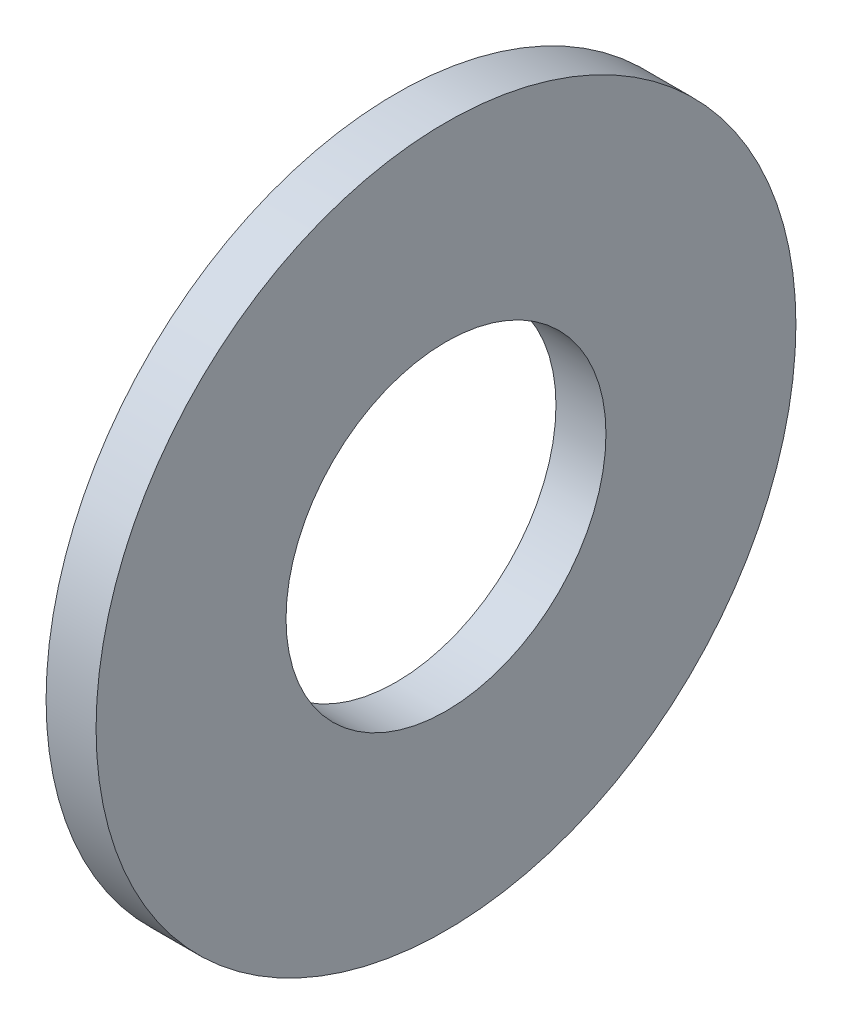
ISO-10303-21;
HEADER;
FILE_DESCRIPTION(('STEP AP214'),'2;1');
FILE_NAME('part.step','',(''),(''),'','','');
FILE_SCHEMA(('AUTOMOTIVE_DESIGN { 1 0 10303 214 1 1 1 1 }'));
ENDSEC;
DATA;
#1=APPLICATION_CONTEXT('core data for automotive mechanical design processes');
#2=APPLICATION_PROTOCOL_DEFINITION('international standard','automotive_design',2000,#1);
#3=PRODUCT_CONTEXT('',#1,'mechanical');
#4=PRODUCT('Part','Part','',(#3));
#5=PRODUCT_RELATED_PRODUCT_CATEGORY('part','',(#4));
#6=PRODUCT_DEFINITION_FORMATION('','',#4);
#7=PRODUCT_DEFINITION_CONTEXT('part definition',#1,'design');
#8=PRODUCT_DEFINITION('design','',#6,#7);
#9=PRODUCT_DEFINITION_SHAPE('','',#8);
#10=(LENGTH_UNIT() NAMED_UNIT(*) SI_UNIT(.MILLI.,.METRE.));
#11=(NAMED_UNIT(*) PLANE_ANGLE_UNIT() SI_UNIT($,.RADIAN.));
#12=(NAMED_UNIT(*) SI_UNIT($,.STERADIAN.) SOLID_ANGLE_UNIT());
#13=UNCERTAINTY_MEASURE_WITH_UNIT(LENGTH_MEASURE(1.E-05),#10,'distance_accuracy_value','');
#14=(GEOMETRIC_REPRESENTATION_CONTEXT(3) GLOBAL_UNCERTAINTY_ASSIGNED_CONTEXT((#13)) GLOBAL_UNIT_ASSIGNED_CONTEXT((#10,
#11,#12)) REPRESENTATION_CONTEXT('',''));
#15=CARTESIAN_POINT('',(0.,0.,0.));
#16=DIRECTION('',(0.,0.,1.));
#17=DIRECTION('',(1.,0.,0.));
#18=AXIS2_PLACEMENT_3D('',#15,#16,#17);
#19=CARTESIAN_POINT('',(6.00000000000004,3.19999999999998,0.));
#20=DIRECTION('',(1.,0.,0.));
#21=DIRECTION('',(0.,0.,-1.));
#22=AXIS2_PLACEMENT_3D('',#19,#20,#21);
#23=PLANE('',#22);
#24=CARTESIAN_POINT('',(6.00000000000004,0.,0.));
#25=DIRECTION('',(-1.,0.,0.));
#26=DIRECTION('',(0.,0.,1.));
#27=AXIS2_PLACEMENT_3D('',#24,#25,#26);
#28=CIRCLE('',#27,3.2);
#29=CARTESIAN_POINT('',(6.00000000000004,0.,3.20000000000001));
#30=VERTEX_POINT('',#29);
#31=EDGE_CURVE('E47',#30,#30,#28,.T.);
#32=ORIENTED_EDGE('',*,*,#31,.F.);
#33=EDGE_LOOP('',(#32));
#34=FACE_BOUND('',#33,.T.);
#35=CARTESIAN_POINT('',(6.00000000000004,0.,0.));
#36=DIRECTION('',(-1.,0.,0.));
#37=DIRECTION('',(0.,0.,1.));
#38=AXIS2_PLACEMENT_3D('',#35,#36,#37);
#39=CIRCLE('',#38,7.);
#40=CARTESIAN_POINT('',(6.00000000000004,0.,7.00000000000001));
#41=VERTEX_POINT('',#40);
#42=EDGE_CURVE('E10',#41,#41,#39,.T.);
#43=ORIENTED_EDGE('',*,*,#42,.T.);
#44=EDGE_LOOP('',(#43));
#45=FACE_BOUND('',#44,.T.);
#46=ADVANCED_FACE('F33',(#34,#45),#23,.F.);
#47=CARTESIAN_POINT('',(0.,0.,0.));
#48=DIRECTION('',(-1.,0.,0.));
#49=DIRECTION('',(0.,0.,1.));
#50=AXIS2_PLACEMENT_3D('',#47,#48,#49);
#51=CYLINDRICAL_SURFACE('',#50,7.);
#52=ORIENTED_EDGE('',*,*,#42,.F.);
#53=EDGE_LOOP('',(#52));
#54=FACE_BOUND('',#53,.T.);
#55=CARTESIAN_POINT('',(7.00000000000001,0.,0.));
#56=DIRECTION('',(-1.,0.,0.));
#57=DIRECTION('',(0.,0.,1.));
#58=AXIS2_PLACEMENT_3D('',#55,#56,#57);
#59=CIRCLE('',#58,7.);
#60=CARTESIAN_POINT('',(7.00000000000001,0.,7.));
#61=VERTEX_POINT('',#60);
#62=EDGE_CURVE('E39',#61,#61,#59,.T.);
#63=ORIENTED_EDGE('',*,*,#62,.T.);
#64=EDGE_LOOP('',(#63));
#65=FACE_BOUND('',#64,.T.);
#66=ADVANCED_FACE('F56',(#54,#65),#51,.T.);
#67=CARTESIAN_POINT('',(7.00000000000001,3.19999999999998,0.));
#68=DIRECTION('',(-1.,0.,0.));
#69=DIRECTION('',(0.,0.,1.));
#70=AXIS2_PLACEMENT_3D('',#67,#68,#69);
#71=PLANE('',#70);
#72=ORIENTED_EDGE('',*,*,#62,.F.);
#73=EDGE_LOOP('',(#72));
#74=FACE_BOUND('',#73,.T.);
#75=CARTESIAN_POINT('',(7.00000000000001,0.,0.));
#76=DIRECTION('',(-1.,0.,0.));
#77=DIRECTION('',(0.,0.,1.));
#78=AXIS2_PLACEMENT_3D('',#75,#76,#77);
#79=CIRCLE('',#78,3.2);
#80=CARTESIAN_POINT('',(7.00000000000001,0.,3.2));
#81=VERTEX_POINT('',#80);
#82=EDGE_CURVE('E43',#81,#81,#79,.T.);
#83=ORIENTED_EDGE('',*,*,#82,.T.);
#84=EDGE_LOOP('',(#83));
#85=FACE_BOUND('',#84,.T.);
#86=ADVANCED_FACE('F60',(#74,#85),#71,.F.);
#87=CARTESIAN_POINT('',(0.,0.,0.));
#88=DIRECTION('',(-1.,0.,0.));
#89=DIRECTION('',(0.,0.,1.));
#90=AXIS2_PLACEMENT_3D('',#87,#88,#89);
#91=CYLINDRICAL_SURFACE('',#90,3.2);
#92=ORIENTED_EDGE('',*,*,#82,.F.);
#93=EDGE_LOOP('',(#92));
#94=FACE_BOUND('',#93,.T.);
#95=ORIENTED_EDGE('',*,*,#31,.T.);
#96=EDGE_LOOP('',(#95));
#97=FACE_BOUND('',#96,.T.);
#98=ADVANCED_FACE('F53',(#94,#97),#91,.F.);
#99=CLOSED_SHELL('',(#46,#66,#86,#98));
#100=MANIFOLD_SOLID_BREP('B2',#99);
#101=ADVANCED_BREP_SHAPE_REPRESENTATION('',(#18,#100),#14);
#102=SHAPE_DEFINITION_REPRESENTATION(#9,#101);
ENDSEC;
END-ISO-10303-21;
